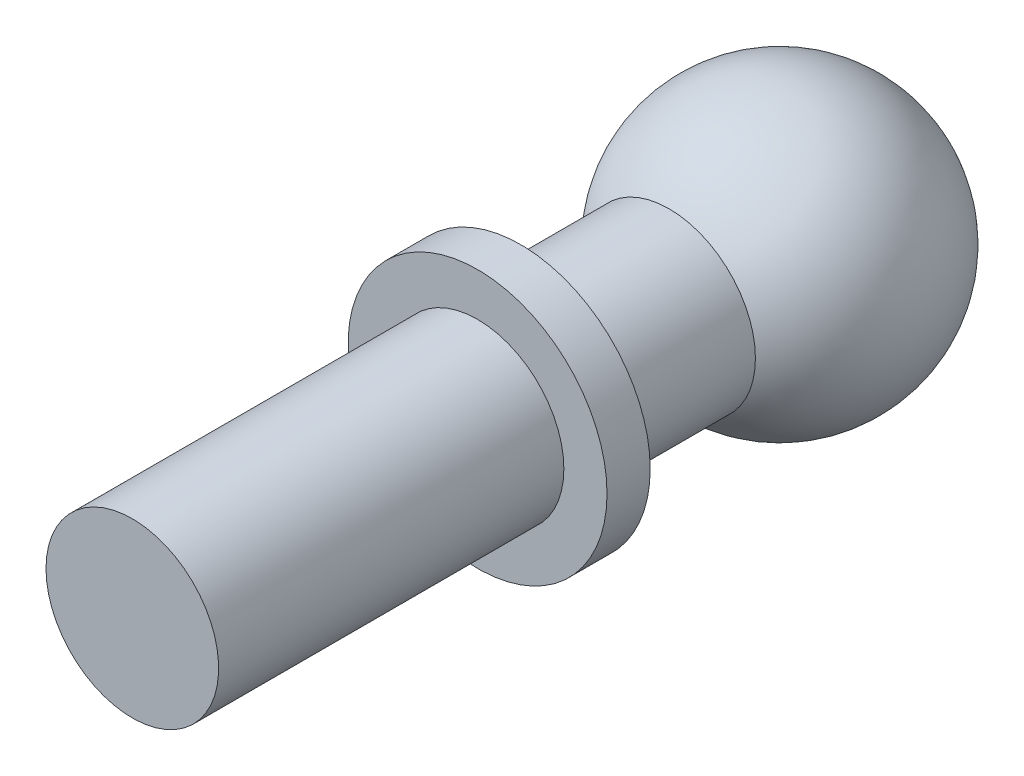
ISO-10303-21;
HEADER;
FILE_DESCRIPTION(('STEP AP214'),'2;1');
FILE_NAME('part.step','',(''),(''),'','','');
FILE_SCHEMA(('AUTOMOTIVE_DESIGN { 1 0 10303 214 1 1 1 1 }'));
ENDSEC;
DATA;
#1=APPLICATION_CONTEXT('core data for automotive mechanical design processes');
#2=APPLICATION_PROTOCOL_DEFINITION('international standard','automotive_design',2000,#1);
#3=PRODUCT_CONTEXT('',#1,'mechanical');
#4=PRODUCT('Part','Part','',(#3));
#5=PRODUCT_RELATED_PRODUCT_CATEGORY('part','',(#4));
#6=PRODUCT_DEFINITION_FORMATION('','',#4);
#7=PRODUCT_DEFINITION_CONTEXT('part definition',#1,'design');
#8=PRODUCT_DEFINITION('design','',#6,#7);
#9=PRODUCT_DEFINITION_SHAPE('','',#8);
#10=(LENGTH_UNIT() NAMED_UNIT(*) SI_UNIT(.MILLI.,.METRE.));
#11=(NAMED_UNIT(*) PLANE_ANGLE_UNIT() SI_UNIT($,.RADIAN.));
#12=(NAMED_UNIT(*) SI_UNIT($,.STERADIAN.) SOLID_ANGLE_UNIT());
#13=UNCERTAINTY_MEASURE_WITH_UNIT(LENGTH_MEASURE(1.E-05),#10,'distance_accuracy_value','');
#14=(GEOMETRIC_REPRESENTATION_CONTEXT(3) GLOBAL_UNCERTAINTY_ASSIGNED_CONTEXT((#13)) GLOBAL_UNIT_ASSIGNED_CONTEXT((#10,
#11,#12)) REPRESENTATION_CONTEXT('',''));
#15=CARTESIAN_POINT('',(0.,0.,0.));
#16=DIRECTION('',(0.,0.,1.));
#17=DIRECTION('',(1.,0.,0.));
#18=AXIS2_PLACEMENT_3D('',#15,#16,#17);
#19=CARTESIAN_POINT('',(0.,0.,0.));
#20=DIRECTION('',(0.,0.,-1.));
#21=DIRECTION('',(-1.,0.,0.));
#22=AXIS2_PLACEMENT_3D('',#19,#20,#21);
#23=CYLINDRICAL_SURFACE('',#22,4.);
#24=CARTESIAN_POINT('',(0.,0.,5.1234753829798));
#25=DIRECTION('',(0.,0.,-1.));
#26=DIRECTION('',(-1.,0.,0.));
#27=AXIS2_PLACEMENT_3D('',#24,#25,#26);
#28=CIRCLE('',#27,4.);
#29=CARTESIAN_POINT('',(-4.,0.,5.1234753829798));
#30=VERTEX_POINT('',#29);
#31=EDGE_CURVE('E51',#30,#30,#28,.T.);
#32=ORIENTED_EDGE('',*,*,#31,.F.);
#33=EDGE_LOOP('',(#32));
#34=FACE_BOUND('',#33,.T.);
#35=CARTESIAN_POINT('',(0.,0.,12.));
#36=DIRECTION('',(0.,0.,1.));
#37=DIRECTION('',(1.,0.,0.));
#38=AXIS2_PLACEMENT_3D('',#35,#36,#37);
#39=CIRCLE('',#38,4.);
#40=CARTESIAN_POINT('',(4.,0.,12.));
#41=VERTEX_POINT('',#40);
#42=EDGE_CURVE('E10',#41,#41,#39,.T.);
#43=ORIENTED_EDGE('',*,*,#42,.F.);
#44=EDGE_LOOP('',(#43));
#45=FACE_BOUND('',#44,.T.);
#46=ADVANCED_FACE('F43',(#34,#45),#23,.T.);
#47=CARTESIAN_POINT('',(0.,0.,0.));
#48=DIRECTION('',(0.,0.,-1.));
#49=DIRECTION('',(1.,0.,0.));
#50=AXIS2_PLACEMENT_3D('',#47,#48,#49);
#51=SPHERICAL_SURFACE('',#50,6.5);
#52=ORIENTED_EDGE('',*,*,#31,.T.);
#53=EDGE_LOOP('',(#52));
#54=FACE_BOUND('',#53,.T.);
#55=ADVANCED_FACE('F85',(#54),#51,.T.);
#56=CARTESIAN_POINT('',(0.,0.,12.));
#57=DIRECTION('',(0.,0.,1.));
#58=DIRECTION('',(1.,0.,0.));
#59=AXIS2_PLACEMENT_3D('',#56,#57,#58);
#60=CYLINDRICAL_SURFACE('',#59,6.);
#61=CARTESIAN_POINT('',(0.,0.,12.));
#62=DIRECTION('',(0.,0.,1.));
#63=DIRECTION('',(1.,0.,0.));
#64=AXIS2_PLACEMENT_3D('',#61,#62,#63);
#65=CIRCLE('',#64,6.);
#66=CARTESIAN_POINT('',(6.,0.,12.));
#67=VERTEX_POINT('',#66);
#68=EDGE_CURVE('E67',#67,#67,#65,.T.);
#69=ORIENTED_EDGE('',*,*,#68,.T.);
#70=EDGE_LOOP('',(#69));
#71=FACE_BOUND('',#70,.T.);
#72=CARTESIAN_POINT('',(0.,0.,14.));
#73=DIRECTION('',(0.,0.,1.));
#74=DIRECTION('',(1.,0.,0.));
#75=AXIS2_PLACEMENT_3D('',#72,#73,#74);
#76=CIRCLE('',#75,6.);
#77=CARTESIAN_POINT('',(6.,0.,14.));
#78=VERTEX_POINT('',#77);
#79=EDGE_CURVE('E72',#78,#78,#76,.T.);
#80=ORIENTED_EDGE('',*,*,#79,.F.);
#81=EDGE_LOOP('',(#80));
#82=FACE_BOUND('',#81,.T.);
#83=ADVANCED_FACE('F82',(#71,#82),#60,.T.);
#84=CARTESIAN_POINT('',(0.,0.,12.));
#85=DIRECTION('',(0.,0.,1.));
#86=DIRECTION('',(1.,0.,0.));
#87=AXIS2_PLACEMENT_3D('',#84,#85,#86);
#88=PLANE('',#87);
#89=ORIENTED_EDGE('',*,*,#42,.T.);
#90=EDGE_LOOP('',(#89));
#91=FACE_BOUND('',#90,.T.);
#92=ORIENTED_EDGE('',*,*,#68,.F.);
#93=EDGE_LOOP('',(#92));
#94=FACE_BOUND('',#93,.T.);
#95=ADVANCED_FACE('F84',(#91,#94),#88,.F.);
#96=CARTESIAN_POINT('',(0.,0.,14.));
#97=DIRECTION('',(0.,0.,1.));
#98=DIRECTION('',(1.,0.,0.));
#99=AXIS2_PLACEMENT_3D('',#96,#97,#98);
#100=PLANE('',#99);
#101=CARTESIAN_POINT('',(0.,0.,14.));
#102=DIRECTION('',(0.,0.,1.));
#103=DIRECTION('',(1.,0.,0.));
#104=AXIS2_PLACEMENT_3D('',#101,#102,#103);
#105=CIRCLE('',#104,4.);
#106=CARTESIAN_POINT('',(4.,0.,14.));
#107=VERTEX_POINT('',#106);
#108=EDGE_CURVE('E62',#107,#107,#105,.T.);
#109=ORIENTED_EDGE('',*,*,#108,.F.);
#110=EDGE_LOOP('',(#109));
#111=FACE_BOUND('',#110,.T.);
#112=ORIENTED_EDGE('',*,*,#79,.T.);
#113=EDGE_LOOP('',(#112));
#114=FACE_BOUND('',#113,.T.);
#115=ADVANCED_FACE('F80',(#111,#114),#100,.T.);
#116=CARTESIAN_POINT('',(0.,0.,30.));
#117=DIRECTION('',(0.,0.,-1.));
#118=DIRECTION('',(-1.,0.,0.));
#119=AXIS2_PLACEMENT_3D('',#116,#117,#118);
#120=PLANE('',#119);
#121=CARTESIAN_POINT('',(0.,0.,30.));
#122=DIRECTION('',(0.,0.,-1.));
#123=DIRECTION('',(-1.,0.,0.));
#124=AXIS2_PLACEMENT_3D('',#121,#122,#123);
#125=CIRCLE('',#124,4.);
#126=CARTESIAN_POINT('',(-4.,0.,30.));
#127=VERTEX_POINT('',#126);
#128=EDGE_CURVE('E56',#127,#127,#125,.T.);
#129=ORIENTED_EDGE('',*,*,#128,.F.);
#130=EDGE_LOOP('',(#129));
#131=FACE_BOUND('',#130,.T.);
#132=ADVANCED_FACE('F45',(#131),#120,.F.);
#133=ORIENTED_EDGE('',*,*,#108,.T.);
#134=EDGE_LOOP('',(#133));
#135=FACE_BOUND('',#134,.T.);
#136=ORIENTED_EDGE('',*,*,#128,.T.);
#137=EDGE_LOOP('',(#136));
#138=FACE_BOUND('',#137,.T.);
#139=ADVANCED_FACE('F96',(#135,#138),#23,.T.);
#140=CLOSED_SHELL('',(#46,#55,#83,#95,#115,#132,#139));
#141=MANIFOLD_SOLID_BREP('B2',#140);
#142=ADVANCED_BREP_SHAPE_REPRESENTATION('',(#18,#141),#14);
#143=SHAPE_DEFINITION_REPRESENTATION(#9,#142);
ENDSEC;
END-ISO-10303-21;
